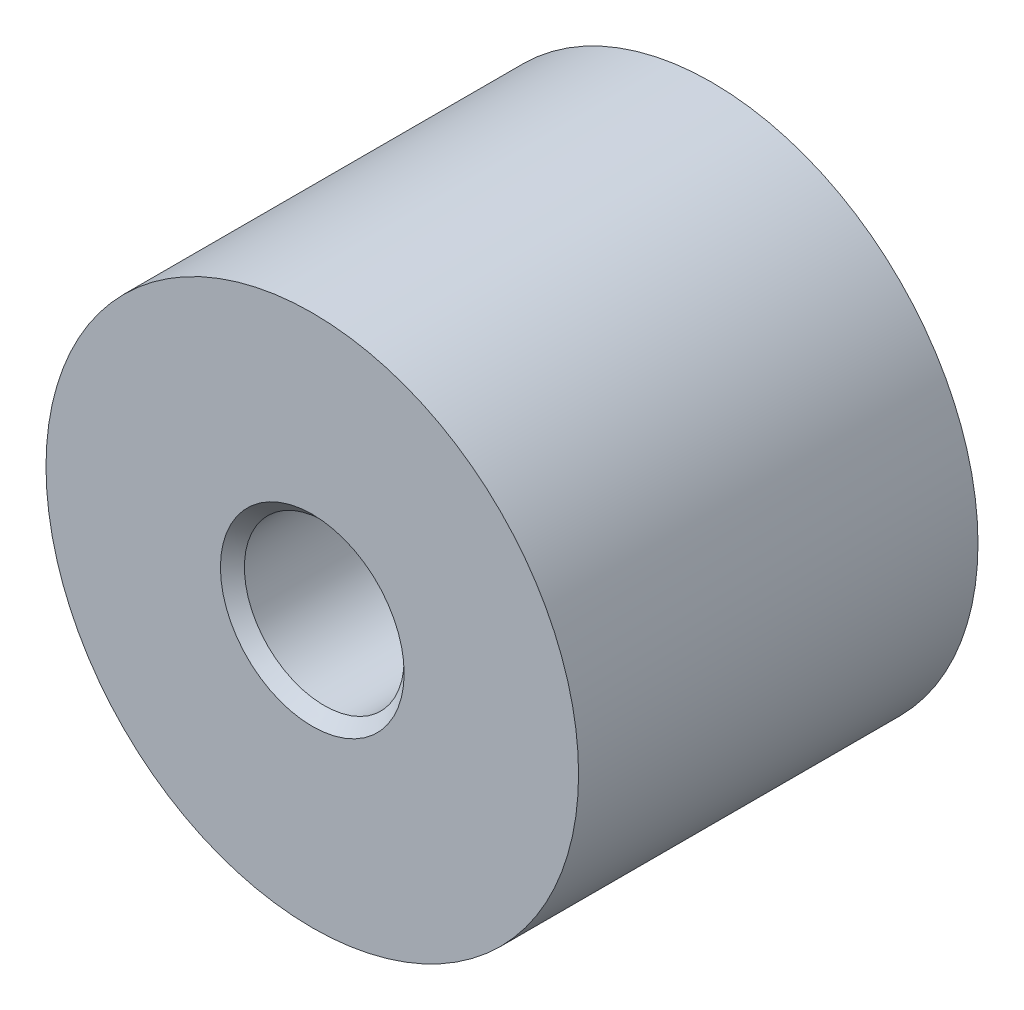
ISO-10303-21;
HEADER;
FILE_DESCRIPTION(('STEP AP214'),'2;1');
FILE_NAME('part.step','',(''),(''),'','','');
FILE_SCHEMA(('AUTOMOTIVE_DESIGN { 1 0 10303 214 1 1 1 1 }'));
ENDSEC;
DATA;
#1=APPLICATION_CONTEXT('core data for automotive mechanical design processes');
#2=APPLICATION_PROTOCOL_DEFINITION('international standard','automotive_design',2000,#1);
#3=PRODUCT_CONTEXT('',#1,'mechanical');
#4=PRODUCT('Part','Part','',(#3));
#5=PRODUCT_RELATED_PRODUCT_CATEGORY('part','',(#4));
#6=PRODUCT_DEFINITION_FORMATION('','',#4);
#7=PRODUCT_DEFINITION_CONTEXT('part definition',#1,'design');
#8=PRODUCT_DEFINITION('design','',#6,#7);
#9=PRODUCT_DEFINITION_SHAPE('','',#8);
#10=(LENGTH_UNIT() NAMED_UNIT(*) SI_UNIT(.MILLI.,.METRE.));
#11=(NAMED_UNIT(*) PLANE_ANGLE_UNIT() SI_UNIT($,.RADIAN.));
#12=(NAMED_UNIT(*) SI_UNIT($,.STERADIAN.) SOLID_ANGLE_UNIT());
#13=UNCERTAINTY_MEASURE_WITH_UNIT(LENGTH_MEASURE(1.E-05),#10,'distance_accuracy_value','');
#14=(GEOMETRIC_REPRESENTATION_CONTEXT(3) GLOBAL_UNCERTAINTY_ASSIGNED_CONTEXT((#13)) GLOBAL_UNIT_ASSIGNED_CONTEXT((#10,
#11,#12)) REPRESENTATION_CONTEXT('',''));
#15=CARTESIAN_POINT('',(0.,0.,0.));
#16=DIRECTION('',(0.,0.,1.));
#17=DIRECTION('',(1.,0.,0.));
#18=AXIS2_PLACEMENT_3D('',#15,#16,#17);
#19=CARTESIAN_POINT('',(0.,0.,9.));
#20=DIRECTION('',(0.,0.,1.));
#21=DIRECTION('',(1.,0.,0.));
#22=AXIS2_PLACEMENT_3D('',#19,#20,#21);
#23=CYLINDRICAL_SURFACE('',#22,3.);
#24=CARTESIAN_POINT('',(0.,0.,14.55));
#25=DIRECTION('',(0.,0.,1.));
#26=DIRECTION('',(1.,0.,0.));
#27=AXIS2_PLACEMENT_3D('',#24,#25,#26);
#28=CIRCLE('',#27,3.);
#29=CARTESIAN_POINT('',(3.,0.,14.55));
#30=VERTEX_POINT('',#29);
#31=EDGE_CURVE('E19',#30,#30,#28,.T.);
#32=ORIENTED_EDGE('',*,*,#31,.T.);
#33=EDGE_LOOP('',(#32));
#34=FACE_BOUND('',#33,.T.);
#35=CARTESIAN_POINT('',(0.,0.,9.));
#36=DIRECTION('',(0.,0.,1.));
#37=DIRECTION('',(1.,0.,0.));
#38=AXIS2_PLACEMENT_3D('',#35,#36,#37);
#39=CIRCLE('',#38,3.);
#40=CARTESIAN_POINT('',(3.,0.,9.));
#41=VERTEX_POINT('',#40);
#42=EDGE_CURVE('E32',#41,#41,#39,.T.);
#43=ORIENTED_EDGE('',*,*,#42,.F.);
#44=EDGE_LOOP('',(#43));
#45=FACE_BOUND('',#44,.T.);
#46=ADVANCED_FACE('F12',(#34,#45),#23,.F.);
#47=CARTESIAN_POINT('',(0.,0.,9.));
#48=DIRECTION('',(0.,0.,1.));
#49=DIRECTION('',(1.,0.,0.));
#50=AXIS2_PLACEMENT_3D('',#47,#48,#49);
#51=PLANE('',#50);
#52=ORIENTED_EDGE('',*,*,#42,.T.);
#53=EDGE_LOOP('',(#52));
#54=FACE_BOUND('',#53,.T.);
#55=ADVANCED_FACE('F36',(#54),#51,.T.);
#56=CARTESIAN_POINT('',(7.,0.,15.));
#57=DIRECTION('',(0.,0.,1.));
#58=DIRECTION('',(0.,-1.,0.));
#59=AXIS2_PLACEMENT_3D('',#56,#57,#58);
#60=PLANE('',#59);
#61=CARTESIAN_POINT('',(0.,0.,15.));
#62=DIRECTION('',(0.,0.,1.));
#63=DIRECTION('',(1.,0.,0.));
#64=AXIS2_PLACEMENT_3D('',#61,#62,#63);
#65=CIRCLE('',#64,3.45);
#66=CARTESIAN_POINT('',(3.45,0.,15.));
#67=VERTEX_POINT('',#66);
#68=EDGE_CURVE('E8',#67,#67,#65,.F.);
#69=ORIENTED_EDGE('',*,*,#68,.T.);
#70=EDGE_LOOP('',(#69));
#71=FACE_BOUND('',#70,.T.);
#72=CARTESIAN_POINT('',(0.,0.,15.));
#73=DIRECTION('',(0.,0.,-1.));
#74=DIRECTION('',(-1.,0.,0.));
#75=AXIS2_PLACEMENT_3D('',#72,#73,#74);
#76=CIRCLE('',#75,10.);
#77=CARTESIAN_POINT('',(-10.,0.,15.));
#78=VERTEX_POINT('',#77);
#79=EDGE_CURVE('E27',#78,#78,#76,.T.);
#80=ORIENTED_EDGE('',*,*,#79,.F.);
#81=EDGE_LOOP('',(#80));
#82=FACE_BOUND('',#81,.T.);
#83=ADVANCED_FACE('F44',(#71,#82),#60,.T.);
#84=CARTESIAN_POINT('',(0.,0.,0.));
#85=DIRECTION('',(0.,0.,-1.));
#86=DIRECTION('',(-1.,0.,0.));
#87=AXIS2_PLACEMENT_3D('',#84,#85,#86);
#88=CYLINDRICAL_SURFACE('',#87,10.);
#89=ORIENTED_EDGE('',*,*,#79,.T.);
#90=EDGE_LOOP('',(#89));
#91=FACE_BOUND('',#90,.T.);
#92=CARTESIAN_POINT('',(0.,0.,0.));
#93=DIRECTION('',(0.,0.,-1.));
#94=DIRECTION('',(-1.,0.,0.));
#95=AXIS2_PLACEMENT_3D('',#92,#93,#94);
#96=CIRCLE('',#95,10.);
#97=CARTESIAN_POINT('',(-10.,0.,0.));
#98=VERTEX_POINT('',#97);
#99=EDGE_CURVE('E23',#98,#98,#96,.T.);
#100=ORIENTED_EDGE('',*,*,#99,.F.);
#101=EDGE_LOOP('',(#100));
#102=FACE_BOUND('',#101,.T.);
#103=ADVANCED_FACE('F47',(#91,#102),#88,.T.);
#104=CARTESIAN_POINT('',(7.5,0.,0.));
#105=DIRECTION('',(0.,0.,-1.));
#106=DIRECTION('',(0.,1.,0.));
#107=AXIS2_PLACEMENT_3D('',#104,#105,#106);
#108=PLANE('',#107);
#109=ORIENTED_EDGE('',*,*,#99,.T.);
#110=EDGE_LOOP('',(#109));
#111=FACE_BOUND('',#110,.T.);
#112=ADVANCED_FACE('F50',(#111),#108,.T.);
#113=CARTESIAN_POINT('',(0.,0.,14.55));
#114=DIRECTION('',(0.,0.,1.));
#115=DIRECTION('',(1.,0.,0.));
#116=AXIS2_PLACEMENT_3D('',#113,#114,#115);
#117=CONICAL_SURFACE('',#116,3.,0.785398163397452);
#118=ORIENTED_EDGE('',*,*,#68,.F.);
#119=EDGE_LOOP('',(#118));
#120=FACE_BOUND('',#119,.T.);
#121=ORIENTED_EDGE('',*,*,#31,.F.);
#122=EDGE_LOOP('',(#121));
#123=FACE_BOUND('',#122,.T.);
#124=ADVANCED_FACE('F14',(#120,#123),#117,.F.);
#125=CLOSED_SHELL('',(#46,#55,#83,#103,#112,#124));
#126=MANIFOLD_SOLID_BREP('B1',#125);
#127=ADVANCED_BREP_SHAPE_REPRESENTATION('',(#18,#126),#14);
#128=SHAPE_DEFINITION_REPRESENTATION(#9,#127);
ENDSEC;
END-ISO-10303-21;
